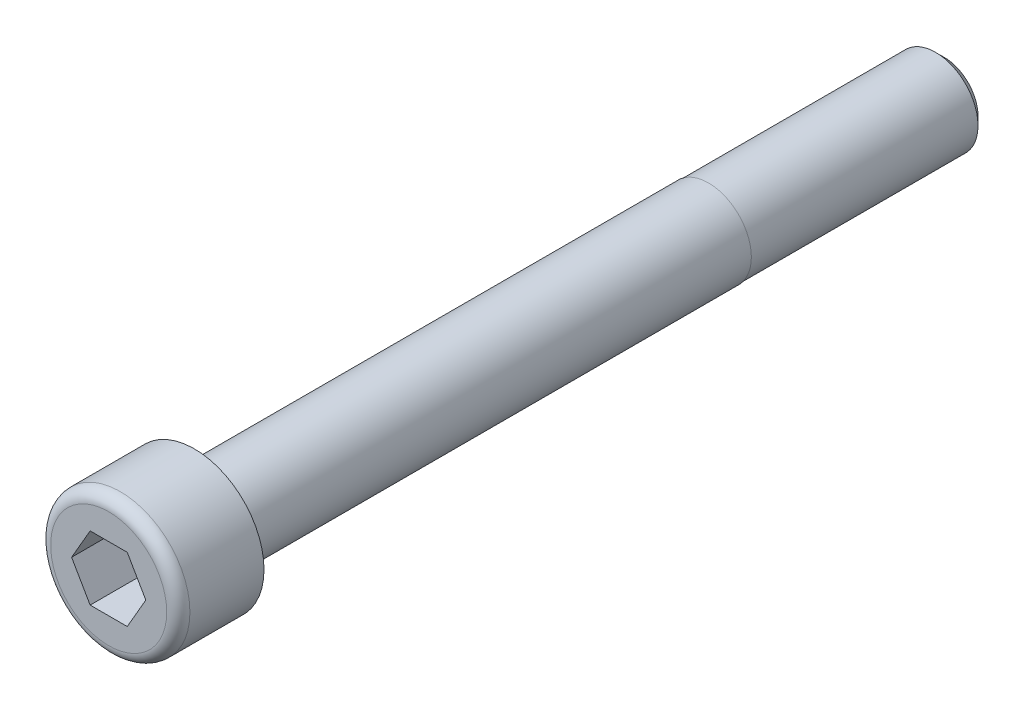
from build123d import *

# Parameters (mm, degrees)
ESQUISSE1_R             = 6.5
BASE_EXTRUSION_DEPTH    = 8
ESQUISSE2_R             = 4
BOSS_EXTRU_1_DEPTH      = 48
ENL_V_MAT_EXTRU_1_DEPTH = 8
ESQUISSE6_R             = 3.95
BOSS_EXTRU_3_DEPTH      = 22
CHANFREIN3_SIZE         = 0.79
CONG_1_R                = 1.083333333


with BuildPart() as part:
    # Esquisse1 → Base-Extrusion (new body)
    with BuildSketch(Plane.XY):
        Circle(ESQUISSE1_R)
    extrude(amount=BASE_EXTRUSION_DEPTH)

    # Esquisse2 → Boss.-Extru.1 (add)
    with BuildSketch(Plane(origin=(0, 0, 0), x_dir=(-1, 0, 0), z_dir=(0, 0, -1))):
        with Locations(Location((0, 0, 0), (0, 0, 180))):
            Circle(ESQUISSE2_R)
    extrude(amount=BOSS_EXTRU_1_DEPTH)

    # Esquisse3 → Enl_v. mat.-Extru.1 (cut)
    with BuildSketch(Plane.XY.offset(8)):
        Polygon((3.464101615, 0), (1.732050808, 3), (-1.732050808, 3), (-3.464101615, 0), (-1.732050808, -3), (1.732050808, -3), align=None)
    extrude(amount=-ENL_V_MAT_EXTRU_1_DEPTH, mode=Mode.SUBTRACT)

    # Esquisse6 → Boss.-Extru.3 (add)
    with BuildSketch(Plane(origin=(0, 0, -48), x_dir=(-1, 0, 0), z_dir=(0, 0, -1))):
        Circle(ESQUISSE6_R)
    extrude(amount=BOSS_EXTRU_3_DEPTH)

    # Chanfrein3
    chanfrein3_edges = [part.edges().sort_by_distance(p)[0] for p in [
        (3.95, 0, -70),
    ]]
    chamfer(chanfrein3_edges, length=CHANFREIN3_SIZE)

    # Cong_1
    cong_1_edges = [part.edges().sort_by_distance(p)[0] for p in [
        (-6.5, 0, 8),
    ]]
    fillet(cong_1_edges, radius=CONG_1_R)


solid = part.part
